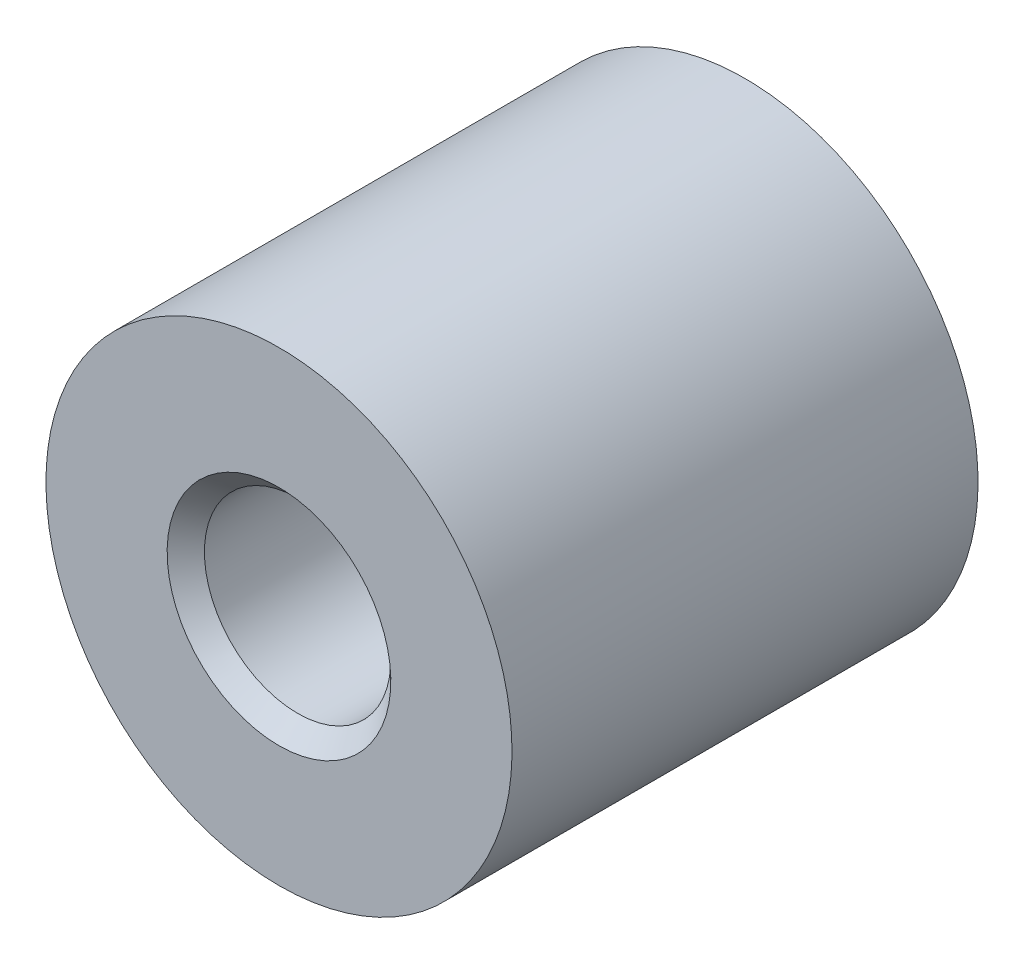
ISO-10303-21;
HEADER;
FILE_DESCRIPTION(('STEP AP214'),'2;1');
FILE_NAME('part.step','',(''),(''),'','','');
FILE_SCHEMA(('AUTOMOTIVE_DESIGN { 1 0 10303 214 1 1 1 1 }'));
ENDSEC;
DATA;
#1=APPLICATION_CONTEXT('core data for automotive mechanical design processes');
#2=APPLICATION_PROTOCOL_DEFINITION('international standard','automotive_design',2000,#1);
#3=PRODUCT_CONTEXT('',#1,'mechanical');
#4=PRODUCT('Part','Part','',(#3));
#5=PRODUCT_RELATED_PRODUCT_CATEGORY('part','',(#4));
#6=PRODUCT_DEFINITION_FORMATION('','',#4);
#7=PRODUCT_DEFINITION_CONTEXT('part definition',#1,'design');
#8=PRODUCT_DEFINITION('design','',#6,#7);
#9=PRODUCT_DEFINITION_SHAPE('','',#8);
#10=(LENGTH_UNIT() NAMED_UNIT(*) SI_UNIT(.MILLI.,.METRE.));
#11=(NAMED_UNIT(*) PLANE_ANGLE_UNIT() SI_UNIT($,.RADIAN.));
#12=(NAMED_UNIT(*) SI_UNIT($,.STERADIAN.) SOLID_ANGLE_UNIT());
#13=UNCERTAINTY_MEASURE_WITH_UNIT(LENGTH_MEASURE(1.E-05),#10,'distance_accuracy_value','');
#14=(GEOMETRIC_REPRESENTATION_CONTEXT(3) GLOBAL_UNCERTAINTY_ASSIGNED_CONTEXT((#13)) GLOBAL_UNIT_ASSIGNED_CONTEXT((#10,
#11,#12)) REPRESENTATION_CONTEXT('',''));
#15=CARTESIAN_POINT('',(0.,0.,0.));
#16=DIRECTION('',(0.,0.,1.));
#17=DIRECTION('',(1.,0.,0.));
#18=AXIS2_PLACEMENT_3D('',#15,#16,#17);
#19=CARTESIAN_POINT('',(4.6666666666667,0.,10.));
#20=DIRECTION('',(0.,0.,1.));
#21=DIRECTION('',(0.,-1.,0.));
#22=AXIS2_PLACEMENT_3D('',#19,#20,#21);
#23=PLANE('',#22);
#24=CARTESIAN_POINT('',(0.,0.,10.));
#25=DIRECTION('',(0.,0.,1.));
#26=DIRECTION('',(0.,-1.,0.));
#27=AXIS2_PLACEMENT_3D('',#24,#25,#26);
#28=CIRCLE('',#27,2.4);
#29=CARTESIAN_POINT('',(0.,-2.4,10.));
#30=VERTEX_POINT('',#29);
#31=EDGE_CURVE('E8',#30,#30,#28,.F.);
#32=ORIENTED_EDGE('',*,*,#31,.T.);
#33=EDGE_LOOP('',(#32));
#34=FACE_BOUND('',#33,.T.);
#35=CARTESIAN_POINT('',(0.,0.,10.));
#36=DIRECTION('',(0.,0.,1.));
#37=DIRECTION('',(0.,-1.,0.));
#38=AXIS2_PLACEMENT_3D('',#35,#36,#37);
#39=CIRCLE('',#38,5.);
#40=CARTESIAN_POINT('',(0.,-5.,10.));
#41=VERTEX_POINT('',#40);
#42=EDGE_CURVE('E23',#41,#41,#39,.T.);
#43=ORIENTED_EDGE('',*,*,#42,.T.);
#44=EDGE_LOOP('',(#43));
#45=FACE_BOUND('',#44,.T.);
#46=ADVANCED_FACE('F12',(#34,#45),#23,.T.);
#47=CARTESIAN_POINT('',(0.,0.,0.));
#48=DIRECTION('',(0.,0.,1.));
#49=DIRECTION('',(0.,-1.,0.));
#50=AXIS2_PLACEMENT_3D('',#47,#48,#49);
#51=CYLINDRICAL_SURFACE('',#50,5.);
#52=CARTESIAN_POINT('',(0.,0.,0.));
#53=DIRECTION('',(0.,0.,1.));
#54=DIRECTION('',(0.,-1.,0.));
#55=AXIS2_PLACEMENT_3D('',#52,#53,#54);
#56=CIRCLE('',#55,5.);
#57=CARTESIAN_POINT('',(0.,-5.,0.));
#58=VERTEX_POINT('',#57);
#59=EDGE_CURVE('E27',#58,#58,#56,.T.);
#60=ORIENTED_EDGE('',*,*,#59,.T.);
#61=EDGE_LOOP('',(#60));
#62=FACE_BOUND('',#61,.T.);
#63=ORIENTED_EDGE('',*,*,#42,.F.);
#64=EDGE_LOOP('',(#63));
#65=FACE_BOUND('',#64,.T.);
#66=ADVANCED_FACE('F48',(#62,#65),#51,.T.);
#67=CARTESIAN_POINT('',(5.,0.,0.));
#68=DIRECTION('',(0.,0.,-1.));
#69=DIRECTION('',(0.,1.,0.));
#70=AXIS2_PLACEMENT_3D('',#67,#68,#69);
#71=PLANE('',#70);
#72=ORIENTED_EDGE('',*,*,#59,.F.);
#73=EDGE_LOOP('',(#72));
#74=FACE_BOUND('',#73,.T.);
#75=ADVANCED_FACE('F40',(#74),#71,.T.);
#76=CARTESIAN_POINT('',(0.,0.,7.3333333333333));
#77=DIRECTION('',(0.,0.,1.));
#78=DIRECTION('',(0.,-1.,0.));
#79=AXIS2_PLACEMENT_3D('',#76,#77,#78);
#80=CYLINDRICAL_SURFACE('',#79,2.);
#81=CARTESIAN_POINT('',(0.,0.,9.6));
#82=DIRECTION('',(0.,0.,1.));
#83=DIRECTION('',(0.,-1.,0.));
#84=AXIS2_PLACEMENT_3D('',#81,#82,#83);
#85=CIRCLE('',#84,2.);
#86=CARTESIAN_POINT('',(0.,-2.,9.6));
#87=VERTEX_POINT('',#86);
#88=EDGE_CURVE('E19',#87,#87,#85,.T.);
#89=ORIENTED_EDGE('',*,*,#88,.T.);
#90=EDGE_LOOP('',(#89));
#91=FACE_BOUND('',#90,.T.);
#92=CARTESIAN_POINT('',(0.,0.,6.));
#93=DIRECTION('',(0.,0.,1.));
#94=DIRECTION('',(0.,-1.,0.));
#95=AXIS2_PLACEMENT_3D('',#92,#93,#94);
#96=CIRCLE('',#95,2.);
#97=CARTESIAN_POINT('',(0.,-2.,6.));
#98=VERTEX_POINT('',#97);
#99=EDGE_CURVE('E32',#98,#98,#96,.T.);
#100=ORIENTED_EDGE('',*,*,#99,.F.);
#101=EDGE_LOOP('',(#100));
#102=FACE_BOUND('',#101,.T.);
#103=ADVANCED_FACE('F38',(#91,#102),#80,.F.);
#104=CARTESIAN_POINT('',(0.,0.,6.));
#105=DIRECTION('',(0.,0.,1.));
#106=DIRECTION('',(0.,-1.,0.));
#107=AXIS2_PLACEMENT_3D('',#104,#105,#106);
#108=PLANE('',#107);
#109=ORIENTED_EDGE('',*,*,#99,.T.);
#110=EDGE_LOOP('',(#109));
#111=FACE_BOUND('',#110,.T.);
#112=ADVANCED_FACE('F36',(#111),#108,.T.);
#113=CARTESIAN_POINT('',(0.,0.,9.6));
#114=DIRECTION('',(0.,0.,1.));
#115=DIRECTION('',(0.,-1.,0.));
#116=AXIS2_PLACEMENT_3D('',#113,#114,#115);
#117=CONICAL_SURFACE('',#116,2.,0.78539816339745);
#118=ORIENTED_EDGE('',*,*,#31,.F.);
#119=EDGE_LOOP('',(#118));
#120=FACE_BOUND('',#119,.T.);
#121=ORIENTED_EDGE('',*,*,#88,.F.);
#122=EDGE_LOOP('',(#121));
#123=FACE_BOUND('',#122,.T.);
#124=ADVANCED_FACE('F14',(#120,#123),#117,.F.);
#125=CLOSED_SHELL('',(#46,#66,#75,#103,#112,#124));
#126=MANIFOLD_SOLID_BREP('B1',#125);
#127=ADVANCED_BREP_SHAPE_REPRESENTATION('',(#18,#126),#14);
#128=SHAPE_DEFINITION_REPRESENTATION(#9,#127);
ENDSEC;
END-ISO-10303-21;
